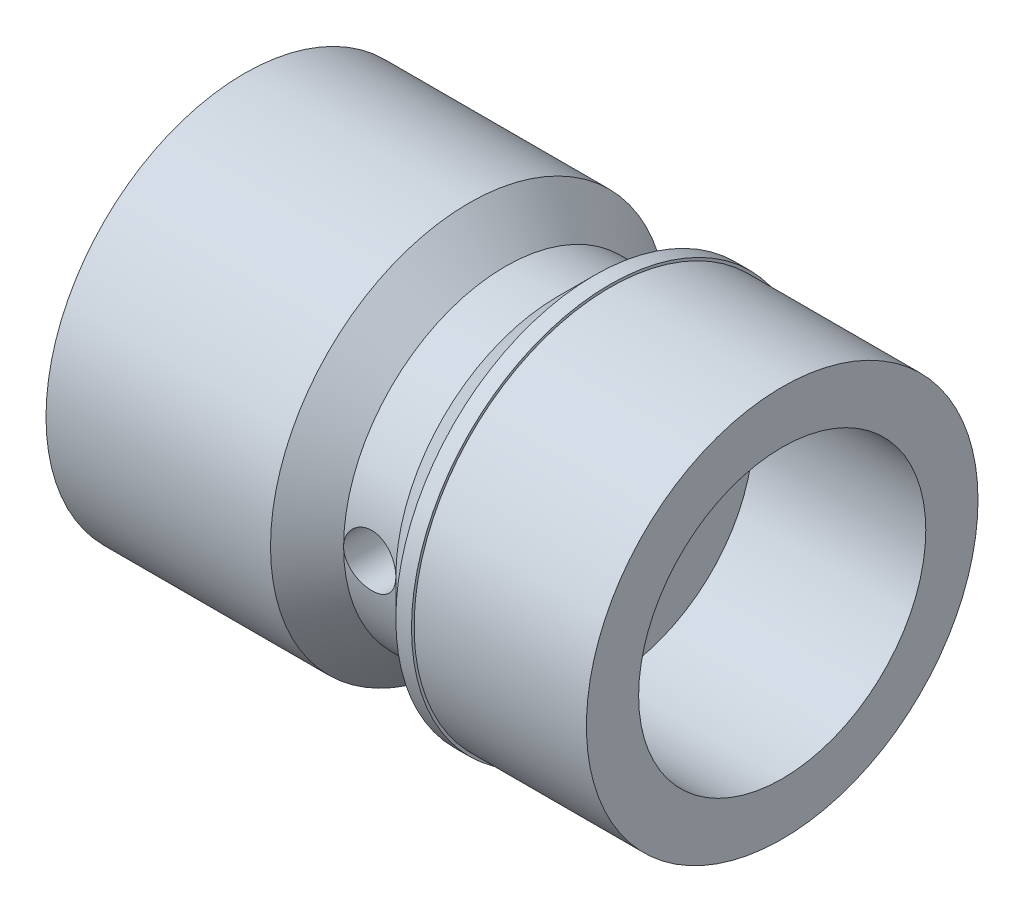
ISO-10303-21;
HEADER;
FILE_DESCRIPTION(('STEP AP214'),'2;1');
FILE_NAME('part.step','',(''),(''),'','','');
FILE_SCHEMA(('AUTOMOTIVE_DESIGN { 1 0 10303 214 1 1 1 1 }'));
ENDSEC;
DATA;
#1=APPLICATION_CONTEXT('core data for automotive mechanical design processes');
#2=APPLICATION_PROTOCOL_DEFINITION('international standard','automotive_design',2000,#1);
#3=PRODUCT_CONTEXT('',#1,'mechanical');
#4=PRODUCT('Part','Part','',(#3));
#5=PRODUCT_RELATED_PRODUCT_CATEGORY('part','',(#4));
#6=PRODUCT_DEFINITION_FORMATION('','',#4);
#7=PRODUCT_DEFINITION_CONTEXT('part definition',#1,'design');
#8=PRODUCT_DEFINITION('design','',#6,#7);
#9=PRODUCT_DEFINITION_SHAPE('','',#8);
#10=(LENGTH_UNIT() NAMED_UNIT(*) SI_UNIT(.MILLI.,.METRE.));
#11=(NAMED_UNIT(*) PLANE_ANGLE_UNIT() SI_UNIT($,.RADIAN.));
#12=(NAMED_UNIT(*) SI_UNIT($,.STERADIAN.) SOLID_ANGLE_UNIT());
#13=UNCERTAINTY_MEASURE_WITH_UNIT(LENGTH_MEASURE(1.E-05),#10,'distance_accuracy_value','');
#14=(GEOMETRIC_REPRESENTATION_CONTEXT(3) GLOBAL_UNCERTAINTY_ASSIGNED_CONTEXT((#13)) GLOBAL_UNIT_ASSIGNED_CONTEXT((#10,
#11,#12)) REPRESENTATION_CONTEXT('',''));
#15=CARTESIAN_POINT('',(0.,0.,0.));
#16=DIRECTION('',(0.,0.,1.));
#17=DIRECTION('',(1.,0.,0.));
#18=AXIS2_PLACEMENT_3D('',#15,#16,#17);
#19=CARTESIAN_POINT('',(1.905,0.,0.));
#20=DIRECTION('',(1.,0.,0.));
#21=DIRECTION('',(0.,0.,-1.));
#22=AXIS2_PLACEMENT_3D('',#19,#20,#21);
#23=CYLINDRICAL_SURFACE('',#22,3.937);
#24=CARTESIAN_POINT('',(-0.635,0.,0.));
#25=DIRECTION('',(1.,0.,0.));
#26=DIRECTION('',(0.,0.,-1.));
#27=AXIS2_PLACEMENT_3D('',#24,#25,#26);
#28=CIRCLE('',#27,3.937);
#29=CARTESIAN_POINT('',(-0.635,0.,3.937));
#30=VERTEX_POINT('',#29);
#31=CARTESIAN_POINT('',(-0.635,0.,-3.937));
#32=VERTEX_POINT('',#31);
#33=EDGE_CURVE('E208',#30,#32,#28,.T.);
#34=ORIENTED_EDGE('',*,*,#33,.T.);
#35=CARTESIAN_POINT('',(-0.635,0.,-3.937));
#36=CARTESIAN_POINT('',(-0.635031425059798,-0.0354804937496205,-3.93701818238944));
#37=CARTESIAN_POINT('',(-0.632028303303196,-0.070946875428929,-3.93652091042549));
#38=CARTESIAN_POINT('',(-0.620190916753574,-0.140824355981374,-3.93463078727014));
#39=CARTESIAN_POINT('',(-0.611364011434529,-0.17523672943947,-3.93323906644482));
#40=CARTESIAN_POINT('',(-0.588113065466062,-0.242081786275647,-3.92969430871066));
#41=CARTESIAN_POINT('',(-0.573687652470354,-0.274513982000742,-3.92754108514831));
#42=CARTESIAN_POINT('',(-0.539669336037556,-0.336498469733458,-3.92271622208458));
#43=CARTESIAN_POINT('',(-0.52007646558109,-0.366050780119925,-3.92004458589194));
#44=CARTESIAN_POINT('',(-0.476092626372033,-0.421697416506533,-3.91445149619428));
#45=CARTESIAN_POINT('',(-0.451664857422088,-0.447762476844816,-3.9115282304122));
#46=CARTESIAN_POINT('',(-0.398781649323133,-0.495445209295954,-3.90577534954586));
#47=CARTESIAN_POINT('',(-0.370325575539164,-0.51706217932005,-3.90294574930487));
#48=CARTESIAN_POINT('',(-0.309993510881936,-0.5553491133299,-3.89768307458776));
#49=CARTESIAN_POINT('',(-0.278098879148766,-0.571990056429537,-3.89525236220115));
#50=CARTESIAN_POINT('',(-0.211923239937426,-0.599666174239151,-3.89108809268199));
#51=CARTESIAN_POINT('',(-0.177642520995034,-0.610702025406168,-3.88935445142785));
#52=CARTESIAN_POINT('',(-0.107979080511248,-0.626763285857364,-3.88679855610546));
#53=CARTESIAN_POINT('',(-0.0726083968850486,-0.631839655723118,-3.88596857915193));
#54=CARTESIAN_POINT('',(-0.00150742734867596,-0.635995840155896,-3.88529059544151));
#55=CARTESIAN_POINT('',(0.0342228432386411,-0.635075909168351,-3.88544254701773));
#56=CARTESIAN_POINT('',(0.104664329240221,-0.627306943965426,-3.88670423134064));
#57=CARTESIAN_POINT('',(0.139382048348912,-0.620515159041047,-3.88780471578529));
#58=CARTESIAN_POINT('',(0.20717841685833,-0.601285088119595,-3.89082499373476));
#59=CARTESIAN_POINT('',(0.24025702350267,-0.588846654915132,-3.89274480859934));
#60=CARTESIAN_POINT('',(0.304009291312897,-0.558617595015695,-3.89719753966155));
#61=CARTESIAN_POINT('',(0.334671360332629,-0.540802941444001,-3.89973319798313));
#62=CARTESIAN_POINT('',(0.392591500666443,-0.500344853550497,-3.90512985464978));
#63=CARTESIAN_POINT('',(0.419849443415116,-0.477701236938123,-3.90799086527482));
#64=CARTESIAN_POINT('',(0.470517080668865,-0.427918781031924,-3.91375628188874));
#65=CARTESIAN_POINT('',(0.493879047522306,-0.400731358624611,-3.91666080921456));
#66=CARTESIAN_POINT('',(0.535722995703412,-0.342787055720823,-3.92215647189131));
#67=CARTESIAN_POINT('',(0.55420359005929,-0.312029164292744,-3.92474751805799));
#68=CARTESIAN_POINT('',(0.585763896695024,-0.247769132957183,-3.92932797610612));
#69=CARTESIAN_POINT('',(0.598836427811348,-0.214263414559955,-3.9313165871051));
#70=CARTESIAN_POINT('',(0.619136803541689,-0.145515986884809,-3.93445958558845));
#71=CARTESIAN_POINT('',(0.626373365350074,-0.110276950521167,-3.93561521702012));
#72=CARTESIAN_POINT('',(0.632059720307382,-0.0623100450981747,-3.93652670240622));
#73=CARTESIAN_POINT('',(0.633162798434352,-0.0498631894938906,-3.936704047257));
#74=CARTESIAN_POINT('',(0.634631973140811,-0.0249460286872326,-3.93694057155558));
#75=CARTESIAN_POINT('',(0.634999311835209,-0.0124757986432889,-3.93699995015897));
#76=CARTESIAN_POINT('',(0.635000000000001,0.,-3.937));
#77=B_SPLINE_CURVE_WITH_KNOTS('',3,(#35,#36,#37,#38,#39,#40,#41,#42,#43,#44,#45,#46,#47,#48,#49,
#50,#51,#52,#53,#54,#55,#56,#57,#58,#59,#60,#61,#62,#63,#64,#65,#66,#67,#68,#69,#70,#71,#72,#73,
#74,#75,#76),.UNSPECIFIED.,.F.,.F.,(4,2,2,2,2,2,2,2,2,2,2,2,2,2,2,2,2,2,2,2,4),(0.,
0.106290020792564,0.212445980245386,0.318627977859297,0.424809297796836,0.531832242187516,
0.63887206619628,0.746524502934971,0.854163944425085,0.960876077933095,1.06758368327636,
1.17326249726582,1.27894406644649,1.38510511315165,1.49127016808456,1.59865298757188,
1.70606628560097,1.81362175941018,1.921016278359,1.95849032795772,1.99590105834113),.UNSPECIFIED.);
#78=CARTESIAN_POINT('',(0.635,0.,-3.937));
#79=VERTEX_POINT('',#78);
#80=EDGE_CURVE('E198',#32,#79,#77,.T.);
#81=ORIENTED_EDGE('',*,*,#80,.T.);
#82=CARTESIAN_POINT('',(0.635,0.,0.));
#83=DIRECTION('',(1.,0.,0.));
#84=DIRECTION('',(0.,0.,-1.));
#85=AXIS2_PLACEMENT_3D('',#82,#83,#84);
#86=CIRCLE('',#85,3.937);
#87=CARTESIAN_POINT('',(0.635,0.,3.937));
#88=VERTEX_POINT('',#87);
#89=EDGE_CURVE('E212',#88,#79,#86,.T.);
#90=ORIENTED_EDGE('',*,*,#89,.F.);
#91=CARTESIAN_POINT('',(0.635,0.,3.937));
#92=CARTESIAN_POINT('',(0.634998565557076,-0.035421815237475,3.93699940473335));
#93=CARTESIAN_POINT('',(0.632026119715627,-0.0708633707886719,3.93651696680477));
#94=CARTESIAN_POINT('',(0.620219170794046,-0.140753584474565,3.93463887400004));
#95=CARTESIAN_POINT('',(0.611379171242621,-0.175201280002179,3.93324236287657));
#96=CARTESIAN_POINT('',(0.588110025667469,-0.24208239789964,3.92969286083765));
#97=CARTESIAN_POINT('',(0.573685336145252,-0.274517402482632,3.9275404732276));
#98=CARTESIAN_POINT('',(0.539667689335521,-0.336502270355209,3.92271627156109));
#99=CARTESIAN_POINT('',(0.520075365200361,-0.366052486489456,3.92004452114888));
#100=CARTESIAN_POINT('',(0.476091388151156,-0.421698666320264,3.9144512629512));
#101=CARTESIAN_POINT('',(0.451662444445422,-0.447764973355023,3.91152792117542));
#102=CARTESIAN_POINT('',(0.398778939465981,-0.49544733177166,3.90577510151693));
#103=CARTESIAN_POINT('',(0.37032413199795,-0.517063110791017,3.90294562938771));
#104=CARTESIAN_POINT('',(0.309994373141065,-0.555348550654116,3.8976831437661));
#105=CARTESIAN_POINT('',(0.278100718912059,-0.571989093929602,3.89525250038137));
#106=CARTESIAN_POINT('',(0.211925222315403,-0.599665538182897,3.89108819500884));
#107=CARTESIAN_POINT('',(0.177643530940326,-0.610701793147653,3.88935448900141));
#108=CARTESIAN_POINT('',(0.107978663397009,-0.626763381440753,3.88679854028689));
#109=CARTESIAN_POINT('',(0.072607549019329,-0.631839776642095,3.88596855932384));
#110=CARTESIAN_POINT('',(0.00150657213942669,-0.635995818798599,3.88529059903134));
#111=CARTESIAN_POINT('',(-0.0342232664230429,-0.63507586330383,3.8854425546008));
#112=CARTESIAN_POINT('',(-0.104664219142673,-0.627306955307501,3.88670422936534));
#113=CARTESIAN_POINT('',(-0.139381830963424,-0.620515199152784,3.88780470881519));
#114=CARTESIAN_POINT('',(-0.20717821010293,-0.601285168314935,3.89082498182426));
#115=CARTESIAN_POINT('',(-0.240256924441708,-0.588846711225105,3.89274480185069));
#116=CARTESIAN_POINT('',(-0.304008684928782,-0.558617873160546,3.89719749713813));
#117=CARTESIAN_POINT('',(-0.334670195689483,-0.540803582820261,3.89973310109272));
#118=CARTESIAN_POINT('',(-0.392590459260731,-0.500345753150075,3.90512974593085));
#119=CARTESIAN_POINT('',(-0.419848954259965,-0.477701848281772,3.9079908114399));
#120=CARTESIAN_POINT('',(-0.470520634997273,-0.427915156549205,3.91375668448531));
#121=CARTESIAN_POINT('',(-0.493885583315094,-0.400723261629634,3.91666161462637));
#122=CARTESIAN_POINT('',(-0.535728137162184,-0.342778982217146,3.92215720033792));
#123=CARTESIAN_POINT('',(-0.554205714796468,-0.312026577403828,3.92474785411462));
#124=CARTESIAN_POINT('',(-0.585752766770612,-0.247790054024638,3.92932633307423));
#125=CARTESIAN_POINT('',(-0.598818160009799,-0.214303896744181,3.9313137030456));
#126=CARTESIAN_POINT('',(-0.619126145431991,-0.145573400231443,3.93445799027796));
#127=CARTESIAN_POINT('',(-0.626369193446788,-0.11032919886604,3.9356149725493));
#128=CARTESIAN_POINT('',(-0.634761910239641,-0.0394990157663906,3.93695942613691));
#129=CARTESIAN_POINT('',(-0.635977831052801,-0.00392107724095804,3.93715743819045));
#130=CARTESIAN_POINT('',(-0.632458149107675,0.0669303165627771,3.9365904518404));
#131=CARTESIAN_POINT('',(-0.627722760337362,0.102203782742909,3.93582548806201));
#132=CARTESIAN_POINT('',(-0.612489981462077,0.171241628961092,3.9334250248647));
#133=CARTESIAN_POINT('',(-0.602025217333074,0.205013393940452,3.93179445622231));
#134=CARTESIAN_POINT('',(-0.575665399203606,0.27032313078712,3.92784492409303));
#135=CARTESIAN_POINT('',(-0.559770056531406,0.301860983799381,3.92552592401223));
#136=CARTESIAN_POINT('',(-0.522847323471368,0.362096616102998,3.92043076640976));
#137=CARTESIAN_POINT('',(-0.501778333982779,0.390768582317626,3.91765096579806));
#138=CARTESIAN_POINT('',(-0.455163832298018,0.444193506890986,3.91195402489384));
#139=CARTESIAN_POINT('',(-0.429618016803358,0.468946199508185,3.90903687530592));
#140=CARTESIAN_POINT('',(-0.374478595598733,0.514074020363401,3.90336015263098));
#141=CARTESIAN_POINT('',(-0.344848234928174,0.534404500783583,3.90060237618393));
#142=CARTESIAN_POINT('',(-0.28255403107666,0.569799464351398,3.89558961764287));
#143=CARTESIAN_POINT('',(-0.249890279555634,0.584864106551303,3.89333462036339));
#144=CARTESIAN_POINT('',(-0.182584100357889,0.609232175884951,3.88959606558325));
#145=CARTESIAN_POINT('',(-0.147950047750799,0.618558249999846,3.88810947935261));
#146=CARTESIAN_POINT('',(-0.077581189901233,0.631256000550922,3.88606831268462));
#147=CARTESIAN_POINT('',(-0.0418464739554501,0.634628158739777,3.88551365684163));
#148=CARTESIAN_POINT('',(0.0292637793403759,0.635309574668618,3.88540225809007));
#149=CARTESIAN_POINT('',(0.0646386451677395,0.632689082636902,3.88583395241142));
#150=CARTESIAN_POINT('',(0.134437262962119,0.621611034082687,3.88762134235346));
#151=CARTESIAN_POINT('',(0.168861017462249,0.613153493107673,3.888977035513));
#152=CARTESIAN_POINT('',(0.235755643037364,0.590667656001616,3.89245539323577));
#153=CARTESIAN_POINT('',(0.268228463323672,0.576645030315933,3.89457727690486));
#154=CARTESIAN_POINT('',(0.330371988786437,0.543434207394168,3.89934975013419));
#155=CARTESIAN_POINT('',(0.360042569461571,0.524245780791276,3.90200036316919));
#156=CARTESIAN_POINT('',(0.416094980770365,0.480995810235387,3.90756847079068));
#157=CARTESIAN_POINT('',(0.442436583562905,0.456882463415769,3.91048860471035));
#158=CARTESIAN_POINT('',(0.490723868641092,0.404576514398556,3.9162453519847));
#159=CARTESIAN_POINT('',(0.512668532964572,0.376382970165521,3.91908194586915));
#160=CARTESIAN_POINT('',(0.551667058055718,0.316502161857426,3.92437304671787));
#161=CARTESIAN_POINT('',(0.568688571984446,0.284793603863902,3.92682498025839));
#162=CARTESIAN_POINT('',(0.597137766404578,0.218941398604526,3.93104540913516));
#163=CARTESIAN_POINT('',(0.608571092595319,0.184800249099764,3.93281459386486));
#164=CARTESIAN_POINT('',(0.623000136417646,0.125432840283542,3.93507815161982));
#165=CARTESIAN_POINT('',(0.627492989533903,0.100568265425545,3.93579504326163));
#166=CARTESIAN_POINT('',(0.63349340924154,0.0504724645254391,3.93675617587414));
#167=CARTESIAN_POINT('',(0.635001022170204,0.0252412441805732,3.93700042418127));
#168=CARTESIAN_POINT('',(0.635,0.,3.937));
#169=B_SPLINE_CURVE_WITH_KNOTS('',3,(#91,#92,#93,#94,#95,#96,#97,#98,#99,#100,#101,#102,#103,
#104,#105,#106,#107,#108,#109,#110,#111,#112,#113,#114,#115,#116,#117,#118,#119,#120,#121,#122,
#123,#124,#125,#126,#127,#128,#129,#130,#131,#132,#133,#134,#135,#136,#137,#138,#139,#140,#141,
#142,#143,#144,#145,#146,#147,#148,#149,#150,#151,#152,#153,#154,#155,#156,#157,#158,#159,#160,
#161,#162,#163,#164,#165,#166,#167,#168),.UNSPECIFIED.,.T.,.F.,(4,2,2,2,2,2,2,2,2,2,2,2,2,2,2,2,
2,2,2,2,2,2,2,2,2,2,2,2,2,2,2,2,2,2,2,2,2,2,4),(0.,0.106173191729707,0.212445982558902,
0.318634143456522,0.424809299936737,0.531837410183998,0.638872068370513,0.74652140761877,
0.854163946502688,0.960877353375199,1.06758368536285,1.17326216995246,1.27894406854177,
1.38510310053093,1.4912701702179,1.59866792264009,1.70606628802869,1.81354549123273,
1.92101627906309,2.02730305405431,2.13358600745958,2.23926993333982,2.34495947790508,
2.45152837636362,2.55810449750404,2.66571125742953,2.77331476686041,2.88049085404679,
2.9876582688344,3.09357583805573,3.19949312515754,3.30530276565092,3.41111710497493,
3.51810777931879,3.62512319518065,3.7328265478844,3.84042086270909,3.91608003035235,
3.99173802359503),.UNSPECIFIED.);
#170=EDGE_CURVE('E61',#88,#30,#169,.T.);
#171=ORIENTED_EDGE('',*,*,#170,.T.);
#172=EDGE_LOOP('',(#34,#81,#90,#171));
#173=FACE_BOUND('',#172,.T.);
#174=ADVANCED_FACE('F39',(#173),#23,.T.);
#175=CARTESIAN_POINT('',(1.905,0.,0.));
#176=DIRECTION('',(1.,0.,0.));
#177=DIRECTION('',(0.,0.,-1.));
#178=AXIS2_PLACEMENT_3D('',#175,#176,#177);
#179=PLANE('',#178);
#180=CARTESIAN_POINT('',(1.905,0.,0.));
#181=DIRECTION('',(1.,0.,0.));
#182=DIRECTION('',(0.,0.,-1.));
#183=AXIS2_PLACEMENT_3D('',#180,#181,#182);
#184=CIRCLE('',#183,4.7625);
#185=CARTESIAN_POINT('',(1.905,0.,-4.7625));
#186=VERTEX_POINT('',#185);
#187=EDGE_CURVE('E164',#186,#186,#184,.T.);
#188=ORIENTED_EDGE('',*,*,#187,.F.);
#189=EDGE_LOOP('',(#188));
#190=FACE_BOUND('',#189,.T.);
#191=CARTESIAN_POINT('',(1.905,0.,0.));
#192=DIRECTION('',(1.,0.,0.));
#193=DIRECTION('',(0.,0.,-1.));
#194=AXIS2_PLACEMENT_3D('',#191,#192,#193);
#195=CIRCLE('',#194,4.826);
#196=CARTESIAN_POINT('',(1.905,0.,-4.826));
#197=VERTEX_POINT('',#196);
#198=EDGE_CURVE('E47',#197,#197,#195,.T.);
#199=ORIENTED_EDGE('',*,*,#198,.T.);
#200=EDGE_LOOP('',(#199));
#201=FACE_BOUND('',#200,.T.);
#202=ADVANCED_FACE('F41',(#190,#201),#179,.T.);
#203=CARTESIAN_POINT('',(1.905,0.,0.));
#204=DIRECTION('',(1.,0.,0.));
#205=DIRECTION('',(0.,0.,-1.));
#206=AXIS2_PLACEMENT_3D('',#203,#204,#205);
#207=CYLINDRICAL_SURFACE('',#206,4.826);
#208=CARTESIAN_POINT('',(1.524,0.,0.));
#209=DIRECTION('',(1.,0.,0.));
#210=DIRECTION('',(0.,0.,-1.));
#211=AXIS2_PLACEMENT_3D('',#208,#209,#210);
#212=CIRCLE('',#211,4.826);
#213=CARTESIAN_POINT('',(1.524,0.,-4.826));
#214=VERTEX_POINT('',#213);
#215=EDGE_CURVE('E216',#214,#214,#212,.T.);
#216=ORIENTED_EDGE('',*,*,#215,.T.);
#217=EDGE_LOOP('',(#216));
#218=FACE_BOUND('',#217,.T.);
#219=ORIENTED_EDGE('',*,*,#198,.F.);
#220=EDGE_LOOP('',(#219));
#221=FACE_BOUND('',#220,.T.);
#222=ADVANCED_FACE('F222',(#218,#221),#207,.T.);
#223=CARTESIAN_POINT('',(1.524,0.,0.));
#224=DIRECTION('',(1.,0.,0.));
#225=DIRECTION('',(0.,0.,-1.));
#226=AXIS2_PLACEMENT_3D('',#223,#224,#225);
#227=CONICAL_SURFACE('',#226,4.826,0.78539816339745);
#228=EDGE_CURVE('E213',#79,#88,#86,.T.);
#229=ORIENTED_EDGE('',*,*,#228,.T.);
#230=ORIENTED_EDGE('',*,*,#89,.T.);
#231=EDGE_LOOP('',(#229,#230));
#232=FACE_BOUND('',#231,.T.);
#233=ORIENTED_EDGE('',*,*,#215,.F.);
#234=EDGE_LOOP('',(#233));
#235=FACE_BOUND('',#234,.T.);
#236=ADVANCED_FACE('F224',(#232,#235),#227,.T.);
#237=ORIENTED_EDGE('',*,*,#228,.F.);
#238=CARTESIAN_POINT('',(0.635,0.,-3.937));
#239=CARTESIAN_POINT('',(0.635031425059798,0.0354804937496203,-3.93701818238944));
#240=CARTESIAN_POINT('',(0.632028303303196,0.0709468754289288,-3.93652091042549));
#241=CARTESIAN_POINT('',(0.620190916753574,0.140824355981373,-3.93463078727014));
#242=CARTESIAN_POINT('',(0.611364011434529,0.17523672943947,-3.93323906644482));
#243=CARTESIAN_POINT('',(0.588113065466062,0.242081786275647,-3.92969430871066));
#244=CARTESIAN_POINT('',(0.573687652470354,0.274513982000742,-3.92754108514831));
#245=CARTESIAN_POINT('',(0.539669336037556,0.336498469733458,-3.92271622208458));
#246=CARTESIAN_POINT('',(0.520076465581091,0.366050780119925,-3.92004458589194));
#247=CARTESIAN_POINT('',(0.476092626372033,0.421697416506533,-3.91445149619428));
#248=CARTESIAN_POINT('',(0.451664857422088,0.447762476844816,-3.9115282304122));
#249=CARTESIAN_POINT('',(0.398781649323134,0.495445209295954,-3.90577534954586));
#250=CARTESIAN_POINT('',(0.370325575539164,0.517062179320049,-3.90294574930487));
#251=CARTESIAN_POINT('',(0.309993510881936,0.5553491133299,-3.89768307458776));
#252=CARTESIAN_POINT('',(0.278098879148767,0.571990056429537,-3.89525236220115));
#253=CARTESIAN_POINT('',(0.211923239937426,0.599666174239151,-3.89108809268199));
#254=CARTESIAN_POINT('',(0.177642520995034,0.610702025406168,-3.88935445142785));
#255=CARTESIAN_POINT('',(0.107979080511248,0.626763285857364,-3.88679855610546));
#256=CARTESIAN_POINT('',(0.0726083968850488,0.631839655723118,-3.88596857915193));
#257=CARTESIAN_POINT('',(0.00150742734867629,0.635995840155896,-3.88529059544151));
#258=CARTESIAN_POINT('',(-0.0342228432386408,0.635075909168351,-3.88544254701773));
#259=CARTESIAN_POINT('',(-0.104664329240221,0.627306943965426,-3.88670423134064));
#260=CARTESIAN_POINT('',(-0.139382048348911,0.620515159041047,-3.88780471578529));
#261=CARTESIAN_POINT('',(-0.207178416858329,0.601285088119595,-3.89082499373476));
#262=CARTESIAN_POINT('',(-0.24025702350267,0.588846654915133,-3.89274480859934));
#263=CARTESIAN_POINT('',(-0.304009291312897,0.558617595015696,-3.89719753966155));
#264=CARTESIAN_POINT('',(-0.334671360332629,0.540802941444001,-3.89973319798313));
#265=CARTESIAN_POINT('',(-0.392591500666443,0.500344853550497,-3.90512985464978));
#266=CARTESIAN_POINT('',(-0.419849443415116,0.477701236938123,-3.90799086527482));
#267=CARTESIAN_POINT('',(-0.470517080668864,0.427918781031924,-3.91375628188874));
#268=CARTESIAN_POINT('',(-0.493879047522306,0.400731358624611,-3.91666080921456));
#269=CARTESIAN_POINT('',(-0.535722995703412,0.342787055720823,-3.92215647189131));
#270=CARTESIAN_POINT('',(-0.554203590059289,0.312029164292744,-3.92474751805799));
#271=CARTESIAN_POINT('',(-0.585763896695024,0.247769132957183,-3.92932797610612));
#272=CARTESIAN_POINT('',(-0.598836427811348,0.214263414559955,-3.9313165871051));
#273=CARTESIAN_POINT('',(-0.619136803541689,0.145515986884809,-3.93445958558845));
#274=CARTESIAN_POINT('',(-0.626373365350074,0.110276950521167,-3.93561521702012));
#275=CARTESIAN_POINT('',(-0.632059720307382,0.0623100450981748,-3.93652670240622));
#276=CARTESIAN_POINT('',(-0.633162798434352,0.0498631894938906,-3.936704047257));
#277=CARTESIAN_POINT('',(-0.634631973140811,0.0249460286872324,-3.93694057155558));
#278=CARTESIAN_POINT('',(-0.634999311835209,0.0124757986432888,-3.93699995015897));
#279=CARTESIAN_POINT('',(-0.635000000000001,0.,-3.937));
#280=B_SPLINE_CURVE_WITH_KNOTS('',3,(#238,#239,#240,#241,#242,#243,#244,#245,#246,#247,#248,
#249,#250,#251,#252,#253,#254,#255,#256,#257,#258,#259,#260,#261,#262,#263,#264,#265,#266,#267,
#268,#269,#270,#271,#272,#273,#274,#275,#276,#277,#278,#279),.UNSPECIFIED.,.F.,.F.,(4,2,2,2,2,2,
2,2,2,2,2,2,2,2,2,2,2,2,2,2,4),(0.,0.106290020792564,0.212445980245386,0.318627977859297,
0.424809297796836,0.531832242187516,0.63887206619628,0.74652450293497,0.854163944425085,
0.960876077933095,1.06758368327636,1.17326249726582,1.27894406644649,1.38510511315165,
1.49127016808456,1.59865298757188,1.70606628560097,1.81362175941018,1.921016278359,
1.95849032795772,1.99590105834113),.UNSPECIFIED.);
#281=EDGE_CURVE('E177',#79,#32,#280,.T.);
#282=ORIENTED_EDGE('',*,*,#281,.T.);
#283=EDGE_CURVE('E209',#32,#30,#28,.T.);
#284=ORIENTED_EDGE('',*,*,#283,.T.);
#285=EDGE_CURVE('E168',#30,#88,#169,.T.);
#286=ORIENTED_EDGE('',*,*,#285,.T.);
#287=EDGE_LOOP('',(#237,#282,#284,#286));
#288=FACE_BOUND('',#287,.T.);
#289=ADVANCED_FACE('F183',(#288),#23,.T.);
#290=CARTESIAN_POINT('',(-1.524,0.,0.));
#291=DIRECTION('',(-1.,0.,0.));
#292=DIRECTION('',(0.,0.,1.));
#293=AXIS2_PLACEMENT_3D('',#290,#291,#292);
#294=CONICAL_SURFACE('',#293,4.826,0.78539816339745);
#295=ORIENTED_EDGE('',*,*,#283,.F.);
#296=ORIENTED_EDGE('',*,*,#33,.F.);
#297=EDGE_LOOP('',(#295,#296));
#298=FACE_BOUND('',#297,.T.);
#299=CARTESIAN_POINT('',(-1.524,0.,0.));
#300=DIRECTION('',(1.,0.,0.));
#301=DIRECTION('',(0.,0.,-1.));
#302=AXIS2_PLACEMENT_3D('',#299,#300,#301);
#303=CIRCLE('',#302,4.826);
#304=CARTESIAN_POINT('',(-1.524,0.,-4.826));
#305=VERTEX_POINT('',#304);
#306=EDGE_CURVE('E205',#305,#305,#303,.T.);
#307=ORIENTED_EDGE('',*,*,#306,.T.);
#308=EDGE_LOOP('',(#307));
#309=FACE_BOUND('',#308,.T.);
#310=ADVANCED_FACE('F239',(#298,#309),#294,.T.);
#311=CARTESIAN_POINT('',(1.905,0.,0.));
#312=DIRECTION('',(1.,0.,0.));
#313=DIRECTION('',(0.,0.,-1.));
#314=AXIS2_PLACEMENT_3D('',#311,#312,#313);
#315=CYLINDRICAL_SURFACE('',#314,4.826);
#316=ORIENTED_EDGE('',*,*,#306,.F.);
#317=EDGE_LOOP('',(#316));
#318=FACE_BOUND('',#317,.T.);
#319=CARTESIAN_POINT('',(-6.985,0.,0.));
#320=DIRECTION('',(-1.,0.,0.));
#321=DIRECTION('',(0.,0.,1.));
#322=AXIS2_PLACEMENT_3D('',#319,#320,#321);
#323=CIRCLE('',#322,4.826);
#324=CARTESIAN_POINT('',(-6.985,0.,4.826));
#325=VERTEX_POINT('',#324);
#326=EDGE_CURVE('E151',#325,#325,#323,.T.);
#327=ORIENTED_EDGE('',*,*,#326,.F.);
#328=EDGE_LOOP('',(#327));
#329=FACE_BOUND('',#328,.T.);
#330=ADVANCED_FACE('F193',(#318,#329),#315,.T.);
#331=CARTESIAN_POINT('',(0.,0.,-4.826));
#332=DIRECTION('',(0.,0.,1.));
#333=DIRECTION('',(1.,0.,0.));
#334=AXIS2_PLACEMENT_3D('',#331,#332,#333);
#335=CYLINDRICAL_SURFACE('',#334,0.635);
#336=ORIENTED_EDGE('',*,*,#285,.F.);
#337=ORIENTED_EDGE('',*,*,#170,.F.);
#338=EDGE_LOOP('',(#336,#337));
#339=FACE_BOUND('',#338,.T.);
#340=ORIENTED_EDGE('',*,*,#281,.F.);
#341=ORIENTED_EDGE('',*,*,#80,.F.);
#342=EDGE_LOOP('',(#340,#341));
#343=FACE_BOUND('',#342,.T.);
#344=ADVANCED_FACE('F187',(#339,#343),#335,.F.);
#345=CARTESIAN_POINT('',(6.096,0.,0.));
#346=DIRECTION('',(1.,0.,0.));
#347=DIRECTION('',(0.,0.,-1.));
#348=AXIS2_PLACEMENT_3D('',#345,#346,#347);
#349=PLANE('',#348);
#350=CARTESIAN_POINT('',(6.096,0.,0.));
#351=DIRECTION('',(1.,0.,0.));
#352=DIRECTION('',(0.,0.,-1.));
#353=AXIS2_PLACEMENT_3D('',#350,#351,#352);
#354=CIRCLE('',#353,4.7625);
#355=CARTESIAN_POINT('',(6.096,0.,-4.7625));
#356=VERTEX_POINT('',#355);
#357=EDGE_CURVE('E165',#356,#356,#354,.T.);
#358=ORIENTED_EDGE('',*,*,#357,.T.);
#359=EDGE_LOOP('',(#358));
#360=FACE_BOUND('',#359,.T.);
#361=CARTESIAN_POINT('',(6.096,0.,0.));
#362=DIRECTION('',(1.,0.,0.));
#363=DIRECTION('',(0.,0.,-1.));
#364=AXIS2_PLACEMENT_3D('',#361,#362,#363);
#365=CIRCLE('',#364,3.4925);
#366=CARTESIAN_POINT('',(6.096,0.,-3.4925));
#367=VERTEX_POINT('',#366);
#368=EDGE_CURVE('E161',#367,#367,#365,.T.);
#369=ORIENTED_EDGE('',*,*,#368,.F.);
#370=EDGE_LOOP('',(#369));
#371=FACE_BOUND('',#370,.T.);
#372=ADVANCED_FACE('F192',(#360,#371),#349,.T.);
#373=CARTESIAN_POINT('',(6.096,0.,0.));
#374=DIRECTION('',(-1.,0.,0.));
#375=DIRECTION('',(0.,0.,1.));
#376=AXIS2_PLACEMENT_3D('',#373,#374,#375);
#377=CYLINDRICAL_SURFACE('',#376,4.7625);
#378=ORIENTED_EDGE('',*,*,#357,.F.);
#379=EDGE_LOOP('',(#378));
#380=FACE_BOUND('',#379,.T.);
#381=ORIENTED_EDGE('',*,*,#187,.T.);
#382=EDGE_LOOP('',(#381));
#383=FACE_BOUND('',#382,.T.);
#384=ADVANCED_FACE('F194',(#380,#383),#377,.T.);
#385=CARTESIAN_POINT('',(6.096,0.,0.));
#386=DIRECTION('',(-1.,0.,0.));
#387=DIRECTION('',(0.,0.,1.));
#388=AXIS2_PLACEMENT_3D('',#385,#386,#387);
#389=CYLINDRICAL_SURFACE('',#388,3.4925);
#390=ORIENTED_EDGE('',*,*,#368,.T.);
#391=EDGE_LOOP('',(#390));
#392=FACE_BOUND('',#391,.T.);
#393=CARTESIAN_POINT('',(1.905,0.,0.));
#394=DIRECTION('',(1.,0.,0.));
#395=DIRECTION('',(0.,0.,-1.));
#396=AXIS2_PLACEMENT_3D('',#393,#394,#395);
#397=CIRCLE('',#396,3.4925);
#398=CARTESIAN_POINT('',(1.905,0.,-3.4925));
#399=VERTEX_POINT('',#398);
#400=EDGE_CURVE('E11',#399,#399,#397,.F.);
#401=ORIENTED_EDGE('',*,*,#400,.T.);
#402=EDGE_LOOP('',(#401));
#403=FACE_BOUND('',#402,.T.);
#404=ADVANCED_FACE('F270',(#392,#403),#389,.F.);
#405=ORIENTED_EDGE('',*,*,#400,.F.);
#406=EDGE_LOOP('',(#405));
#407=FACE_BOUND('',#406,.T.);
#408=ADVANCED_FACE('F232',(#407),#179,.T.);
#409=CARTESIAN_POINT('',(-6.985,0.,0.));
#410=DIRECTION('',(-1.,0.,0.));
#411=DIRECTION('',(0.,0.,1.));
#412=AXIS2_PLACEMENT_3D('',#409,#410,#411);
#413=PLANE('',#412);
#414=DIRECTION('',(0.,0.866025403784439,0.5));
#415=VECTOR('',#414,1.);
#416=CARTESIAN_POINT('',(-6.985,-1.25000004,0.721687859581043));
#417=LINE('',#416,#415);
#418=CARTESIAN_POINT('',(-6.985,-1.25000004,0.721687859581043));
#419=VERTEX_POINT('',#418);
#420=CARTESIAN_POINT('',(-6.985,0.,1.44337571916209));
#421=VERTEX_POINT('',#420);
#422=EDGE_CURVE('E54',#419,#421,#417,.T.);
#423=ORIENTED_EDGE('',*,*,#422,.F.);
#424=DIRECTION('',(0.,0.,1.));
#425=VECTOR('',#424,1.);
#426=CARTESIAN_POINT('',(-6.985,-1.25000004,-0.721687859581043));
#427=LINE('',#426,#425);
#428=CARTESIAN_POINT('',(-6.985,-1.25000004,-0.721687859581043));
#429=VERTEX_POINT('',#428);
#430=EDGE_CURVE('E125',#429,#419,#427,.T.);
#431=ORIENTED_EDGE('',*,*,#430,.F.);
#432=DIRECTION('',(0.,-0.866025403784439,0.5));
#433=VECTOR('',#432,1.);
#434=CARTESIAN_POINT('',(-6.985,0.,-1.44337571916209));
#435=LINE('',#434,#433);
#436=CARTESIAN_POINT('',(-6.985,0.,-1.44337571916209));
#437=VERTEX_POINT('',#436);
#438=EDGE_CURVE('E128',#437,#429,#435,.T.);
#439=ORIENTED_EDGE('',*,*,#438,.F.);
#440=DIRECTION('',(0.,-0.866025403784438,-0.5));
#441=VECTOR('',#440,1.);
#442=CARTESIAN_POINT('',(-6.985,1.25000004,-0.721687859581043));
#443=LINE('',#442,#441);
#444=CARTESIAN_POINT('',(-6.985,1.25000004,-0.721687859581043));
#445=VERTEX_POINT('',#444);
#446=EDGE_CURVE('E144',#445,#437,#443,.T.);
#447=ORIENTED_EDGE('',*,*,#446,.F.);
#448=DIRECTION('',(0.,0.,-1.));
#449=VECTOR('',#448,1.);
#450=CARTESIAN_POINT('',(-6.985,1.25000004,0.721687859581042));
#451=LINE('',#450,#449);
#452=CARTESIAN_POINT('',(-6.985,1.25000004,0.721687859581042));
#453=VERTEX_POINT('',#452);
#454=EDGE_CURVE('E141',#453,#445,#451,.T.);
#455=ORIENTED_EDGE('',*,*,#454,.F.);
#456=DIRECTION('',(0.,0.866025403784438,-0.5));
#457=VECTOR('',#456,1.);
#458=CARTESIAN_POINT('',(-6.985,0.,1.44337571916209));
#459=LINE('',#458,#457);
#460=EDGE_CURVE('E139',#421,#453,#459,.T.);
#461=ORIENTED_EDGE('',*,*,#460,.F.);
#462=EDGE_LOOP('',(#423,#431,#439,#447,#455,#461));
#463=FACE_BOUND('',#462,.T.);
#464=ORIENTED_EDGE('',*,*,#326,.T.);
#465=EDGE_LOOP('',(#464));
#466=FACE_BOUND('',#465,.T.);
#467=ADVANCED_FACE('F260',(#463,#466),#413,.T.);
#468=CARTESIAN_POINT('',(-1.905,-1.25000004,0.721687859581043));
#469=DIRECTION('',(0.,-0.5,0.866025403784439));
#470=DIRECTION('',(0.,-0.866025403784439,-0.5));
#471=AXIS2_PLACEMENT_3D('',#468,#469,#470);
#472=PLANE('',#471);
#473=ORIENTED_EDGE('',*,*,#422,.T.);
#474=DIRECTION('',(-1.,0.,0.));
#475=VECTOR('',#474,1.);
#476=CARTESIAN_POINT('',(-1.905,0.,1.44337571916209));
#477=LINE('',#476,#475);
#478=CARTESIAN_POINT('',(-1.905,0.,1.44337571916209));
#479=VERTEX_POINT('',#478);
#480=EDGE_CURVE('E102',#479,#421,#477,.T.);
#481=ORIENTED_EDGE('',*,*,#480,.F.);
#482=DIRECTION('',(0.,0.866025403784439,0.5));
#483=VECTOR('',#482,1.);
#484=CARTESIAN_POINT('',(-1.905,-1.25000004,0.721687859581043));
#485=LINE('',#484,#483);
#486=CARTESIAN_POINT('',(-1.905,-1.25000004,0.721687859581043));
#487=VERTEX_POINT('',#486);
#488=EDGE_CURVE('E106',#487,#479,#485,.T.);
#489=ORIENTED_EDGE('',*,*,#488,.F.);
#490=DIRECTION('',(-1.,0.,0.));
#491=VECTOR('',#490,1.);
#492=CARTESIAN_POINT('',(-1.905,-1.25000004,0.721687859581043));
#493=LINE('',#492,#491);
#494=EDGE_CURVE('E149',#487,#419,#493,.T.);
#495=ORIENTED_EDGE('',*,*,#494,.T.);
#496=EDGE_LOOP('',(#473,#481,#489,#495));
#497=FACE_BOUND('',#496,.T.);
#498=ADVANCED_FACE('F104',(#497),#472,.F.);
#499=CARTESIAN_POINT('',(-1.905,-1.25000004,-0.721687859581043));
#500=DIRECTION('',(0.,-1.,0.));
#501=DIRECTION('',(0.,0.,-1.));
#502=AXIS2_PLACEMENT_3D('',#499,#500,#501);
#503=PLANE('',#502);
#504=ORIENTED_EDGE('',*,*,#430,.T.);
#505=ORIENTED_EDGE('',*,*,#494,.F.);
#506=DIRECTION('',(0.,0.,1.));
#507=VECTOR('',#506,1.);
#508=CARTESIAN_POINT('',(-1.905,-1.25000004,-0.721687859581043));
#509=LINE('',#508,#507);
#510=CARTESIAN_POINT('',(-1.905,-1.25000004,-0.721687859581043));
#511=VERTEX_POINT('',#510);
#512=EDGE_CURVE('E112',#511,#487,#509,.T.);
#513=ORIENTED_EDGE('',*,*,#512,.F.);
#514=DIRECTION('',(-1.,0.,0.));
#515=VECTOR('',#514,1.);
#516=CARTESIAN_POINT('',(-1.905,-1.25000004,-0.721687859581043));
#517=LINE('',#516,#515);
#518=EDGE_CURVE('E152',#511,#429,#517,.T.);
#519=ORIENTED_EDGE('',*,*,#518,.T.);
#520=EDGE_LOOP('',(#504,#505,#513,#519));
#521=FACE_BOUND('',#520,.T.);
#522=ADVANCED_FACE('F267',(#521),#503,.F.);
#523=CARTESIAN_POINT('',(-1.905,0.,-1.44337571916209));
#524=DIRECTION('',(0.,-0.5,-0.866025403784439));
#525=DIRECTION('',(0.,0.866025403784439,-0.5));
#526=AXIS2_PLACEMENT_3D('',#523,#524,#525);
#527=PLANE('',#526);
#528=ORIENTED_EDGE('',*,*,#438,.T.);
#529=ORIENTED_EDGE('',*,*,#518,.F.);
#530=DIRECTION('',(0.,-0.866025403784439,0.5));
#531=VECTOR('',#530,1.);
#532=CARTESIAN_POINT('',(-1.905,0.,-1.44337571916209));
#533=LINE('',#532,#531);
#534=CARTESIAN_POINT('',(-1.905,0.,-1.44337571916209));
#535=VERTEX_POINT('',#534);
#536=EDGE_CURVE('E135',#535,#511,#533,.T.);
#537=ORIENTED_EDGE('',*,*,#536,.F.);
#538=DIRECTION('',(-1.,0.,0.));
#539=VECTOR('',#538,1.);
#540=CARTESIAN_POINT('',(-1.905,0.,-1.44337571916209));
#541=LINE('',#540,#539);
#542=EDGE_CURVE('E154',#535,#437,#541,.T.);
#543=ORIENTED_EDGE('',*,*,#542,.T.);
#544=EDGE_LOOP('',(#528,#529,#537,#543));
#545=FACE_BOUND('',#544,.T.);
#546=ADVANCED_FACE('F323',(#545),#527,.F.);
#547=CARTESIAN_POINT('',(-1.905,1.25000004,-0.721687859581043));
#548=DIRECTION('',(0.,0.5,-0.866025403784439));
#549=DIRECTION('',(0.,0.866025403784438,0.5));
#550=AXIS2_PLACEMENT_3D('',#547,#548,#549);
#551=PLANE('',#550);
#552=ORIENTED_EDGE('',*,*,#446,.T.);
#553=ORIENTED_EDGE('',*,*,#542,.F.);
#554=DIRECTION('',(0.,-0.866025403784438,-0.5));
#555=VECTOR('',#554,1.);
#556=CARTESIAN_POINT('',(-1.905,1.25000004,-0.721687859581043));
#557=LINE('',#556,#555);
#558=CARTESIAN_POINT('',(-1.905,1.25000004,-0.721687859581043));
#559=VERTEX_POINT('',#558);
#560=EDGE_CURVE('E132',#559,#535,#557,.T.);
#561=ORIENTED_EDGE('',*,*,#560,.F.);
#562=DIRECTION('',(-1.,0.,0.));
#563=VECTOR('',#562,1.);
#564=CARTESIAN_POINT('',(-1.905,1.25000004,-0.721687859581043));
#565=LINE('',#564,#563);
#566=EDGE_CURVE('E156',#559,#445,#565,.T.);
#567=ORIENTED_EDGE('',*,*,#566,.T.);
#568=EDGE_LOOP('',(#552,#553,#561,#567));
#569=FACE_BOUND('',#568,.T.);
#570=ADVANCED_FACE('F333',(#569),#551,.F.);
#571=CARTESIAN_POINT('',(-1.905,1.25000004,0.721687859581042));
#572=DIRECTION('',(0.,1.,0.));
#573=DIRECTION('',(0.,0.,1.));
#574=AXIS2_PLACEMENT_3D('',#571,#572,#573);
#575=PLANE('',#574);
#576=ORIENTED_EDGE('',*,*,#454,.T.);
#577=ORIENTED_EDGE('',*,*,#566,.F.);
#578=DIRECTION('',(0.,0.,-1.));
#579=VECTOR('',#578,1.);
#580=CARTESIAN_POINT('',(-1.905,1.25000004,0.721687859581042));
#581=LINE('',#580,#579);
#582=CARTESIAN_POINT('',(-1.905,1.25000004,0.721687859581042));
#583=VERTEX_POINT('',#582);
#584=EDGE_CURVE('E120',#583,#559,#581,.T.);
#585=ORIENTED_EDGE('',*,*,#584,.F.);
#586=DIRECTION('',(-1.,0.,0.));
#587=VECTOR('',#586,1.);
#588=CARTESIAN_POINT('',(-1.905,1.25000004,0.721687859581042));
#589=LINE('',#588,#587);
#590=EDGE_CURVE('E111',#583,#453,#589,.T.);
#591=ORIENTED_EDGE('',*,*,#590,.T.);
#592=EDGE_LOOP('',(#576,#577,#585,#591));
#593=FACE_BOUND('',#592,.T.);
#594=ADVANCED_FACE('F343',(#593),#575,.F.);
#595=CARTESIAN_POINT('',(-1.905,0.,1.44337571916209));
#596=DIRECTION('',(0.,0.5,0.866025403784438));
#597=DIRECTION('',(0.,-0.866025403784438,0.5));
#598=AXIS2_PLACEMENT_3D('',#595,#596,#597);
#599=PLANE('',#598);
#600=ORIENTED_EDGE('',*,*,#460,.T.);
#601=ORIENTED_EDGE('',*,*,#590,.F.);
#602=DIRECTION('',(0.,0.866025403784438,-0.5));
#603=VECTOR('',#602,1.);
#604=CARTESIAN_POINT('',(-1.905,0.,1.44337571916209));
#605=LINE('',#604,#603);
#606=EDGE_CURVE('E115',#479,#583,#605,.T.);
#607=ORIENTED_EDGE('',*,*,#606,.F.);
#608=ORIENTED_EDGE('',*,*,#480,.T.);
#609=EDGE_LOOP('',(#600,#601,#607,#608));
#610=FACE_BOUND('',#609,.T.);
#611=ADVANCED_FACE('F116',(#610),#599,.F.);
#612=CARTESIAN_POINT('',(-1.905,0.,0.));
#613=DIRECTION('',(-1.,0.,0.));
#614=DIRECTION('',(0.,0.,1.));
#615=AXIS2_PLACEMENT_3D('',#612,#613,#614);
#616=PLANE('',#615);
#617=ORIENTED_EDGE('',*,*,#488,.T.);
#618=ORIENTED_EDGE('',*,*,#606,.T.);
#619=ORIENTED_EDGE('',*,*,#584,.T.);
#620=ORIENTED_EDGE('',*,*,#560,.T.);
#621=ORIENTED_EDGE('',*,*,#536,.T.);
#622=ORIENTED_EDGE('',*,*,#512,.T.);
#623=EDGE_LOOP('',(#617,#618,#619,#620,#621,#622));
#624=FACE_BOUND('',#623,.T.);
#625=ADVANCED_FACE('F122',(#624),#616,.T.);
#626=CLOSED_SHELL('',(#174,#202,#222,#236,#289,#310,#330,#344,#372,#384,#404,#408,#467,#498,
#522,#546,#570,#594,#611,#625));
#627=MANIFOLD_SOLID_BREP('B2',#626);
#628=ADVANCED_BREP_SHAPE_REPRESENTATION('',(#18,#627),#14);
#629=SHAPE_DEFINITION_REPRESENTATION(#9,#628);
ENDSEC;
END-ISO-10303-21;
